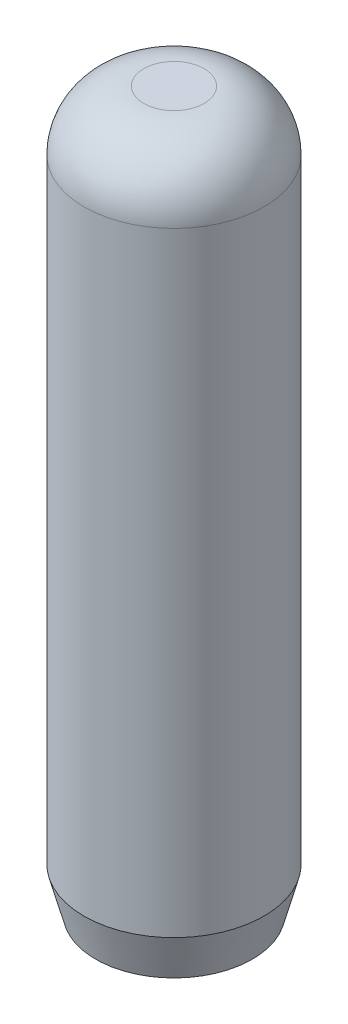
ISO-10303-21;
HEADER;
FILE_DESCRIPTION(('STEP AP214'),'2;1');
FILE_NAME('part.step','',(''),(''),'','','');
FILE_SCHEMA(('AUTOMOTIVE_DESIGN { 1 0 10303 214 1 1 1 1 }'));
ENDSEC;
DATA;
#1=APPLICATION_CONTEXT('core data for automotive mechanical design processes');
#2=APPLICATION_PROTOCOL_DEFINITION('international standard','automotive_design',2000,#1);
#3=PRODUCT_CONTEXT('',#1,'mechanical');
#4=PRODUCT('Part','Part','',(#3));
#5=PRODUCT_RELATED_PRODUCT_CATEGORY('part','',(#4));
#6=PRODUCT_DEFINITION_FORMATION('','',#4);
#7=PRODUCT_DEFINITION_CONTEXT('part definition',#1,'design');
#8=PRODUCT_DEFINITION('design','',#6,#7);
#9=PRODUCT_DEFINITION_SHAPE('','',#8);
#10=(LENGTH_UNIT() NAMED_UNIT(*) SI_UNIT(.MILLI.,.METRE.));
#11=(NAMED_UNIT(*) PLANE_ANGLE_UNIT() SI_UNIT($,.RADIAN.));
#12=(NAMED_UNIT(*) SI_UNIT($,.STERADIAN.) SOLID_ANGLE_UNIT());
#13=UNCERTAINTY_MEASURE_WITH_UNIT(LENGTH_MEASURE(1.E-05),#10,'distance_accuracy_value','');
#14=(GEOMETRIC_REPRESENTATION_CONTEXT(3) GLOBAL_UNCERTAINTY_ASSIGNED_CONTEXT((#13)) GLOBAL_UNIT_ASSIGNED_CONTEXT((#10,
#11,#12)) REPRESENTATION_CONTEXT('',''));
#15=CARTESIAN_POINT('',(0.,0.,0.));
#16=DIRECTION('',(0.,0.,1.));
#17=DIRECTION('',(1.,0.,0.));
#18=AXIS2_PLACEMENT_3D('',#15,#16,#17);
#19=CARTESIAN_POINT('',(0.,8.73125,0.));
#20=DIRECTION('',(0.,-1.,0.));
#21=DIRECTION('',(0.,0.,-1.));
#22=AXIS2_PLACEMENT_3D('',#19,#20,#21);
#23=DEGENERATE_TOROIDAL_SURFACE('',#22,0.400685,0.79375,.T.);
#24=CARTESIAN_POINT('',(0.,9.525,0.));
#25=DIRECTION('',(0.,-1.,0.));
#26=DIRECTION('',(0.,0.,-1.));
#27=AXIS2_PLACEMENT_3D('',#24,#25,#26);
#28=CIRCLE('',#27,0.400685);
#29=CARTESIAN_POINT('',(0.,9.525,-0.400685));
#30=VERTEX_POINT('',#29);
#31=EDGE_CURVE('E10',#30,#30,#28,.T.);
#32=ORIENTED_EDGE('',*,*,#31,.T.);
#33=EDGE_LOOP('',(#32));
#34=FACE_BOUND('',#33,.T.);
#35=CARTESIAN_POINT('',(0.,8.73125,0.));
#36=DIRECTION('',(0.,-1.,0.));
#37=DIRECTION('',(0.,0.,-1.));
#38=AXIS2_PLACEMENT_3D('',#35,#36,#37);
#39=CIRCLE('',#38,1.194435);
#40=CARTESIAN_POINT('',(0.,8.73125,-1.194435));
#41=VERTEX_POINT('',#40);
#42=EDGE_CURVE('E49',#41,#41,#39,.T.);
#43=ORIENTED_EDGE('',*,*,#42,.F.);
#44=EDGE_LOOP('',(#43));
#45=FACE_BOUND('',#44,.T.);
#46=ADVANCED_FACE('F35',(#34,#45),#23,.T.);
#47=CARTESIAN_POINT('',(0.,9.525,0.));
#48=DIRECTION('',(0.,-1.,0.));
#49=DIRECTION('',(0.,0.,-1.));
#50=AXIS2_PLACEMENT_3D('',#47,#48,#49);
#51=PLANE('',#50);
#52=ORIENTED_EDGE('',*,*,#31,.F.);
#53=EDGE_LOOP('',(#52));
#54=FACE_BOUND('',#53,.T.);
#55=ADVANCED_FACE('F58',(#54),#51,.F.);
#56=CARTESIAN_POINT('',(1.04113882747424,0.,0.));
#57=DIRECTION('',(0.,1.,0.));
#58=DIRECTION('',(0.,0.,1.));
#59=AXIS2_PLACEMENT_3D('',#56,#57,#58);
#60=PLANE('',#59);
#61=CARTESIAN_POINT('',(0.,0.,0.));
#62=DIRECTION('',(0.,-1.,0.));
#63=DIRECTION('',(0.,0.,-1.));
#64=AXIS2_PLACEMENT_3D('',#61,#62,#63);
#65=CIRCLE('',#64,1.04113882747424);
#66=CARTESIAN_POINT('',(0.,0.,-1.04113882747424));
#67=VERTEX_POINT('',#66);
#68=EDGE_CURVE('E41',#67,#67,#65,.T.);
#69=ORIENTED_EDGE('',*,*,#68,.T.);
#70=EDGE_LOOP('',(#69));
#71=FACE_BOUND('',#70,.T.);
#72=ADVANCED_FACE('F62',(#71),#60,.F.);
#73=CARTESIAN_POINT('',(0.,0.572109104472,0.));
#74=DIRECTION('',(0.,1.,0.));
#75=DIRECTION('',(0.,0.,1.));
#76=AXIS2_PLACEMENT_3D('',#73,#74,#75);
#77=CONICAL_SURFACE('',#76,1.194435,0.261799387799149);
#78=ORIENTED_EDGE('',*,*,#68,.F.);
#79=EDGE_LOOP('',(#78));
#80=FACE_BOUND('',#79,.T.);
#81=CARTESIAN_POINT('',(0.,0.572109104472,0.));
#82=DIRECTION('',(0.,-1.,0.));
#83=DIRECTION('',(0.,0.,-1.));
#84=AXIS2_PLACEMENT_3D('',#81,#82,#83);
#85=CIRCLE('',#84,1.194435);
#86=CARTESIAN_POINT('',(0.,0.572109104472,-1.194435));
#87=VERTEX_POINT('',#86);
#88=EDGE_CURVE('E45',#87,#87,#85,.T.);
#89=ORIENTED_EDGE('',*,*,#88,.T.);
#90=EDGE_LOOP('',(#89));
#91=FACE_BOUND('',#90,.T.);
#92=ADVANCED_FACE('F67',(#80,#91),#77,.T.);
#93=CARTESIAN_POINT('',(0.,0.,0.));
#94=DIRECTION('',(0.,-1.,0.));
#95=DIRECTION('',(0.,0.,-1.));
#96=AXIS2_PLACEMENT_3D('',#93,#94,#95);
#97=CYLINDRICAL_SURFACE('',#96,1.194435);
#98=ORIENTED_EDGE('',*,*,#88,.F.);
#99=EDGE_LOOP('',(#98));
#100=FACE_BOUND('',#99,.T.);
#101=ORIENTED_EDGE('',*,*,#42,.T.);
#102=EDGE_LOOP('',(#101));
#103=FACE_BOUND('',#102,.T.);
#104=ADVANCED_FACE('F55',(#100,#103),#97,.T.);
#105=CLOSED_SHELL('',(#46,#55,#72,#92,#104));
#106=MANIFOLD_SOLID_BREP('B2',#105);
#107=ADVANCED_BREP_SHAPE_REPRESENTATION('',(#18,#106),#14);
#108=SHAPE_DEFINITION_REPRESENTATION(#9,#107);
ENDSEC;
END-ISO-10303-21;
